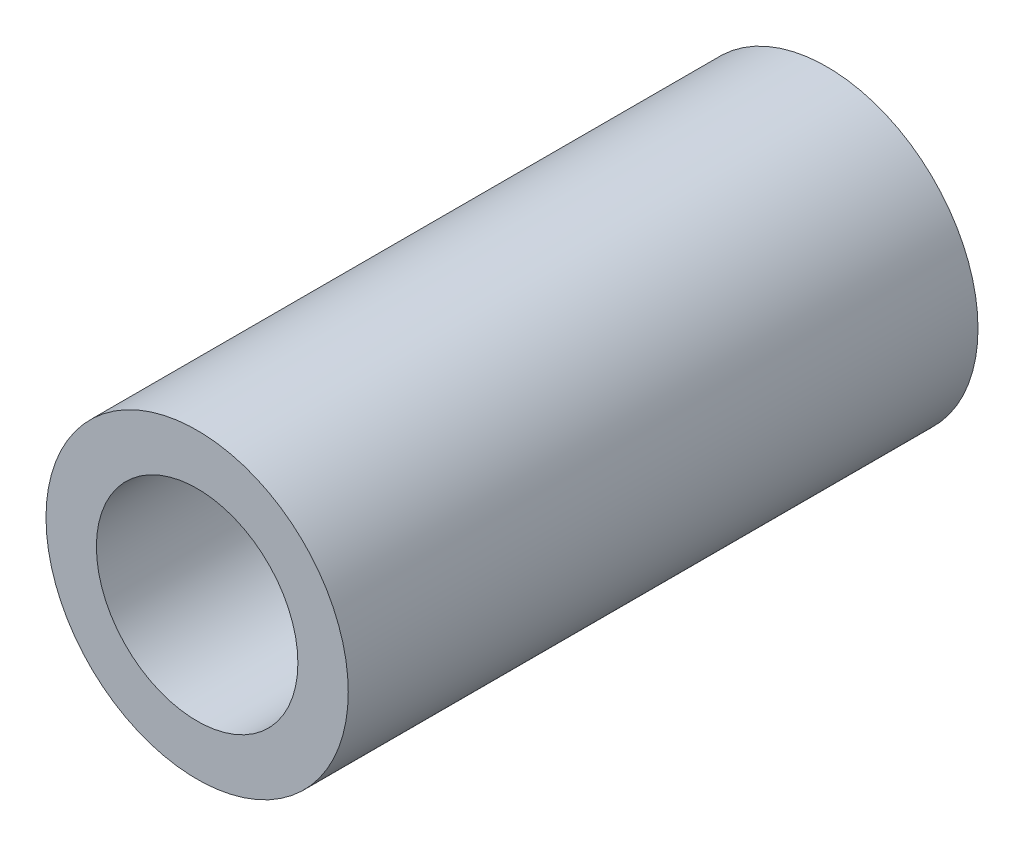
ISO-10303-21;
HEADER;
FILE_DESCRIPTION(('STEP AP214'),'2;1');
FILE_NAME('part.step','',(''),(''),'','','');
FILE_SCHEMA(('AUTOMOTIVE_DESIGN { 1 0 10303 214 1 1 1 1 }'));
ENDSEC;
DATA;
#1=APPLICATION_CONTEXT('core data for automotive mechanical design processes');
#2=APPLICATION_PROTOCOL_DEFINITION('international standard','automotive_design',2000,#1);
#3=PRODUCT_CONTEXT('',#1,'mechanical');
#4=PRODUCT('Part','Part','',(#3));
#5=PRODUCT_RELATED_PRODUCT_CATEGORY('part','',(#4));
#6=PRODUCT_DEFINITION_FORMATION('','',#4);
#7=PRODUCT_DEFINITION_CONTEXT('part definition',#1,'design');
#8=PRODUCT_DEFINITION('design','',#6,#7);
#9=PRODUCT_DEFINITION_SHAPE('','',#8);
#10=(LENGTH_UNIT() NAMED_UNIT(*) SI_UNIT(.MILLI.,.METRE.));
#11=(NAMED_UNIT(*) PLANE_ANGLE_UNIT() SI_UNIT($,.RADIAN.));
#12=(NAMED_UNIT(*) SI_UNIT($,.STERADIAN.) SOLID_ANGLE_UNIT());
#13=UNCERTAINTY_MEASURE_WITH_UNIT(LENGTH_MEASURE(1.E-05),#10,'distance_accuracy_value','');
#14=(GEOMETRIC_REPRESENTATION_CONTEXT(3) GLOBAL_UNCERTAINTY_ASSIGNED_CONTEXT((#13)) GLOBAL_UNIT_ASSIGNED_CONTEXT((#10,
#11,#12)) REPRESENTATION_CONTEXT('',''));
#15=CARTESIAN_POINT('',(0.,0.,0.));
#16=DIRECTION('',(0.,0.,1.));
#17=DIRECTION('',(1.,0.,0.));
#18=AXIS2_PLACEMENT_3D('',#15,#16,#17);
#19=CARTESIAN_POINT('',(0.,0.,12.5));
#20=DIRECTION('',(0.,0.,1.));
#21=DIRECTION('',(1.,0.,0.));
#22=AXIS2_PLACEMENT_3D('',#19,#20,#21);
#23=PLANE('',#22);
#24=CARTESIAN_POINT('',(0.,0.,12.5));
#25=DIRECTION('',(0.,0.,1.));
#26=DIRECTION('',(1.,0.,0.));
#27=AXIS2_PLACEMENT_3D('',#24,#25,#26);
#28=CIRCLE('',#27,3.);
#29=CARTESIAN_POINT('',(3.,0.,12.5));
#30=VERTEX_POINT('',#29);
#31=EDGE_CURVE('E10',#30,#30,#28,.T.);
#32=ORIENTED_EDGE('',*,*,#31,.T.);
#33=EDGE_LOOP('',(#32));
#34=FACE_BOUND('',#33,.T.);
#35=CARTESIAN_POINT('',(0.,0.,12.5));
#36=DIRECTION('',(0.,0.,1.));
#37=DIRECTION('',(1.,0.,0.));
#38=AXIS2_PLACEMENT_3D('',#35,#36,#37);
#39=CIRCLE('',#38,2.);
#40=CARTESIAN_POINT('',(2.,0.,12.5));
#41=VERTEX_POINT('',#40);
#42=EDGE_CURVE('E26',#41,#41,#39,.T.);
#43=ORIENTED_EDGE('',*,*,#42,.F.);
#44=EDGE_LOOP('',(#43));
#45=FACE_BOUND('',#44,.T.);
#46=ADVANCED_FACE('F15',(#34,#45),#23,.T.);
#47=CARTESIAN_POINT('',(0.,0.,0.));
#48=DIRECTION('',(0.,0.,1.));
#49=DIRECTION('',(1.,0.,0.));
#50=AXIS2_PLACEMENT_3D('',#47,#48,#49);
#51=PLANE('',#50);
#52=CARTESIAN_POINT('',(0.,0.,0.));
#53=DIRECTION('',(0.,0.,1.));
#54=DIRECTION('',(1.,0.,0.));
#55=AXIS2_PLACEMENT_3D('',#52,#53,#54);
#56=CIRCLE('',#55,3.);
#57=CARTESIAN_POINT('',(3.,0.,0.));
#58=VERTEX_POINT('',#57);
#59=EDGE_CURVE('E19',#58,#58,#56,.T.);
#60=ORIENTED_EDGE('',*,*,#59,.F.);
#61=EDGE_LOOP('',(#60));
#62=FACE_BOUND('',#61,.T.);
#63=CARTESIAN_POINT('',(0.,0.,0.));
#64=DIRECTION('',(0.,0.,1.));
#65=DIRECTION('',(1.,0.,0.));
#66=AXIS2_PLACEMENT_3D('',#63,#64,#65);
#67=CIRCLE('',#66,2.);
#68=CARTESIAN_POINT('',(2.,0.,0.));
#69=VERTEX_POINT('',#68);
#70=EDGE_CURVE('E28',#69,#69,#67,.T.);
#71=ORIENTED_EDGE('',*,*,#70,.T.);
#72=EDGE_LOOP('',(#71));
#73=FACE_BOUND('',#72,.T.);
#74=ADVANCED_FACE('F38',(#62,#73),#51,.F.);
#75=CARTESIAN_POINT('',(0.,0.,12.5));
#76=DIRECTION('',(0.,0.,-1.));
#77=DIRECTION('',(-1.,0.,0.));
#78=AXIS2_PLACEMENT_3D('',#75,#76,#77);
#79=CYLINDRICAL_SURFACE('',#78,3.);
#80=ORIENTED_EDGE('',*,*,#31,.F.);
#81=EDGE_LOOP('',(#80));
#82=FACE_BOUND('',#81,.T.);
#83=ORIENTED_EDGE('',*,*,#59,.T.);
#84=EDGE_LOOP('',(#83));
#85=FACE_BOUND('',#84,.T.);
#86=ADVANCED_FACE('F17',(#82,#85),#79,.T.);
#87=CARTESIAN_POINT('',(0.,0.,12.5));
#88=DIRECTION('',(0.,0.,-1.));
#89=DIRECTION('',(-1.,0.,0.));
#90=AXIS2_PLACEMENT_3D('',#87,#88,#89);
#91=CYLINDRICAL_SURFACE('',#90,2.);
#92=ORIENTED_EDGE('',*,*,#42,.T.);
#93=EDGE_LOOP('',(#92));
#94=FACE_BOUND('',#93,.T.);
#95=ORIENTED_EDGE('',*,*,#70,.F.);
#96=EDGE_LOOP('',(#95));
#97=FACE_BOUND('',#96,.T.);
#98=ADVANCED_FACE('F34',(#94,#97),#91,.F.);
#99=CLOSED_SHELL('',(#46,#74,#86,#98));
#100=MANIFOLD_SOLID_BREP('B1',#99);
#101=ADVANCED_BREP_SHAPE_REPRESENTATION('',(#18,#100),#14);
#102=SHAPE_DEFINITION_REPRESENTATION(#9,#101);
ENDSEC;
END-ISO-10303-21;
